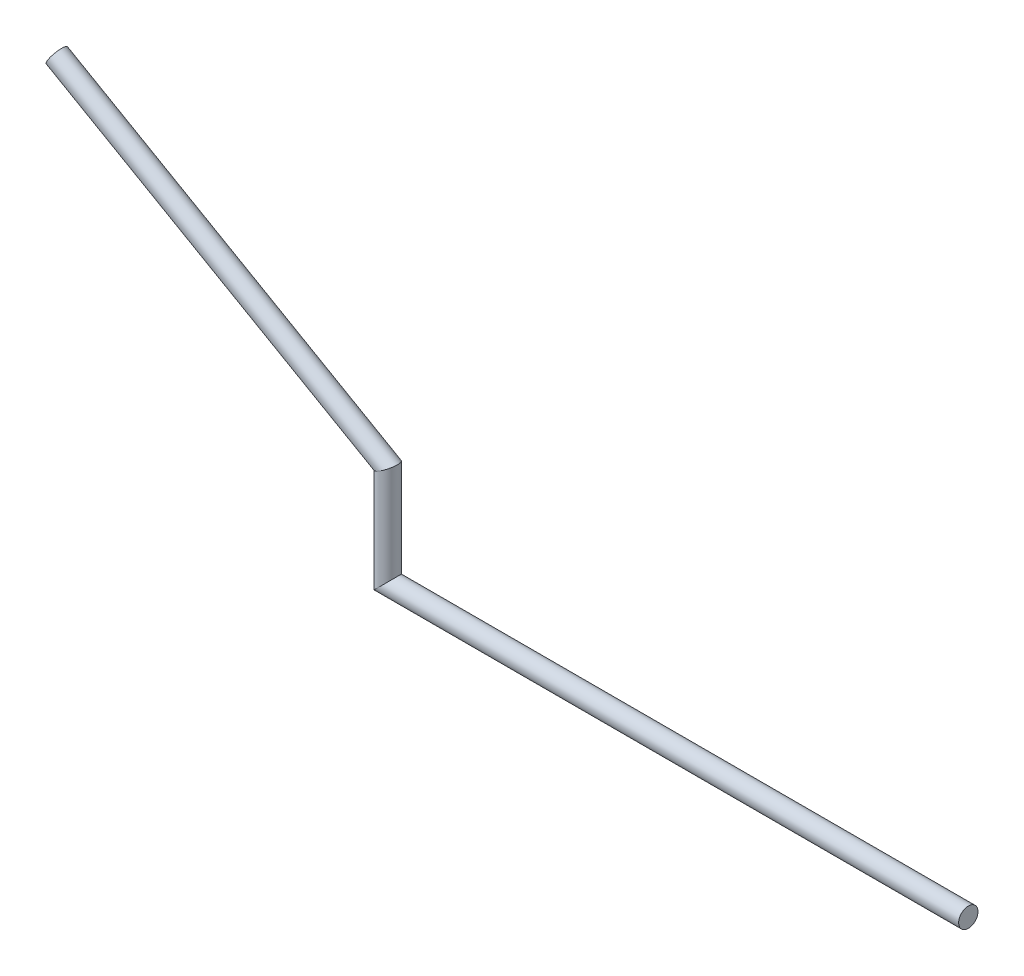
from build123d import *

# Parameters (mm, degrees)
SKETCH3_R = 1.27


with BuildPart() as part:
    # Sweep1: sweep along a path in Sketch2
    with BuildLine(Plane.XY) as sweep1_path:
        Line((0, 0), (-76.2, 0))
        Line((-76.2, 0), (-76.2, 13.230106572))
        Line((-76.2, 13.230106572), (-119.643826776, 38.156394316))
    # Sketch3 → Sweep1 (sweep)
    with BuildSketch(Plane(origin=(0, 0, 0), x_dir=(0, 0, -1), z_dir=(1, 0, 0))):
        Circle(SKETCH3_R)
    sweep(path=sweep1_path.line, transition=Transition.RIGHT)


solid = part.part
